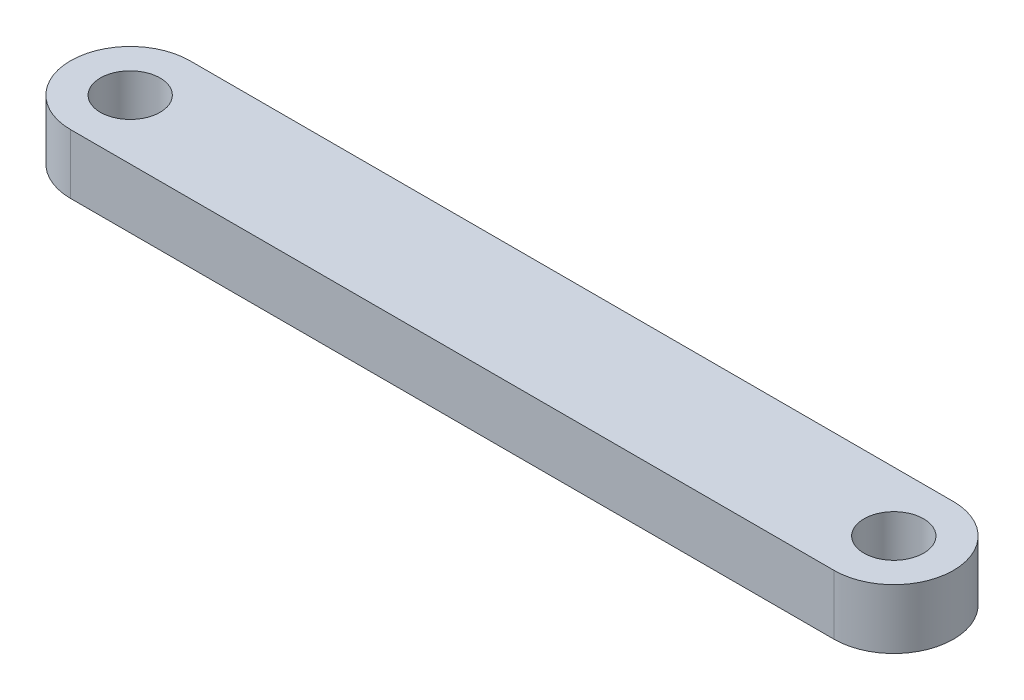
ISO-10303-21;
HEADER;
FILE_DESCRIPTION(('STEP AP214'),'2;1');
FILE_NAME('part.step','',(''),(''),'','','');
FILE_SCHEMA(('AUTOMOTIVE_DESIGN { 1 0 10303 214 1 1 1 1 }'));
ENDSEC;
DATA;
#1=APPLICATION_CONTEXT('core data for automotive mechanical design processes');
#2=APPLICATION_PROTOCOL_DEFINITION('international standard','automotive_design',2000,#1);
#3=PRODUCT_CONTEXT('',#1,'mechanical');
#4=PRODUCT('Part','Part','',(#3));
#5=PRODUCT_RELATED_PRODUCT_CATEGORY('part','',(#4));
#6=PRODUCT_DEFINITION_FORMATION('','',#4);
#7=PRODUCT_DEFINITION_CONTEXT('part definition',#1,'design');
#8=PRODUCT_DEFINITION('design','',#6,#7);
#9=PRODUCT_DEFINITION_SHAPE('','',#8);
#10=(LENGTH_UNIT() NAMED_UNIT(*) SI_UNIT(.MILLI.,.METRE.));
#11=(NAMED_UNIT(*) PLANE_ANGLE_UNIT() SI_UNIT($,.RADIAN.));
#12=(NAMED_UNIT(*) SI_UNIT($,.STERADIAN.) SOLID_ANGLE_UNIT());
#13=UNCERTAINTY_MEASURE_WITH_UNIT(LENGTH_MEASURE(1.E-05),#10,'distance_accuracy_value','');
#14=(GEOMETRIC_REPRESENTATION_CONTEXT(3) GLOBAL_UNCERTAINTY_ASSIGNED_CONTEXT((#13)) GLOBAL_UNIT_ASSIGNED_CONTEXT((#10,
#11,#12)) REPRESENTATION_CONTEXT('',''));
#15=CARTESIAN_POINT('',(0.,0.,0.));
#16=DIRECTION('',(0.,0.,1.));
#17=DIRECTION('',(1.,0.,0.));
#18=AXIS2_PLACEMENT_3D('',#15,#16,#17);
#19=CARTESIAN_POINT('',(-640.,50.,0.));
#20=DIRECTION('',(0.,1.,0.));
#21=DIRECTION('',(0.,0.,1.));
#22=AXIS2_PLACEMENT_3D('',#19,#20,#21);
#23=PLANE('',#22);
#24=CARTESIAN_POINT('',(-640.,50.,0.));
#25=DIRECTION('',(0.,1.,0.));
#26=DIRECTION('',(0.,0.,1.));
#27=AXIS2_PLACEMENT_3D('',#24,#25,#26);
#28=CIRCLE('',#27,50.);
#29=CARTESIAN_POINT('',(-640.,50.,50.));
#30=VERTEX_POINT('',#29);
#31=EDGE_CURVE('E113',#30,#30,#28,.T.);
#32=ORIENTED_EDGE('',*,*,#31,.F.);
#33=EDGE_LOOP('',(#32));
#34=FACE_BOUND('',#33,.T.);
#35=CARTESIAN_POINT('',(-640.,50.,0.));
#36=DIRECTION('',(0.,1.,0.));
#37=DIRECTION('',(0.,0.,1.));
#38=AXIS2_PLACEMENT_3D('',#35,#36,#37);
#39=CIRCLE('',#38,100.);
#40=CARTESIAN_POINT('',(-640.,50.,-100.));
#41=VERTEX_POINT('',#40);
#42=CARTESIAN_POINT('',(-640.,50.,100.));
#43=VERTEX_POINT('',#42);
#44=EDGE_CURVE('E91',#41,#43,#39,.T.);
#45=ORIENTED_EDGE('',*,*,#44,.T.);
#46=DIRECTION('',(1.,0.,0.));
#47=VECTOR('',#46,1.);
#48=CARTESIAN_POINT('',(-640.,50.,100.));
#49=LINE('',#48,#47);
#50=CARTESIAN_POINT('',(640.,50.,100.));
#51=VERTEX_POINT('',#50);
#52=EDGE_CURVE('E86',#43,#51,#49,.T.);
#53=ORIENTED_EDGE('',*,*,#52,.T.);
#54=CARTESIAN_POINT('',(640.,50.,0.));
#55=DIRECTION('',(0.,1.,0.));
#56=DIRECTION('',(0.,0.,1.));
#57=AXIS2_PLACEMENT_3D('',#54,#55,#56);
#58=CIRCLE('',#57,100.);
#59=CARTESIAN_POINT('',(640.,50.,-100.));
#60=VERTEX_POINT('',#59);
#61=EDGE_CURVE('E89',#51,#60,#58,.T.);
#62=ORIENTED_EDGE('',*,*,#61,.T.);
#63=DIRECTION('',(-1.,0.,0.));
#64=VECTOR('',#63,1.);
#65=CARTESIAN_POINT('',(-640.,50.,-100.));
#66=LINE('',#65,#64);
#67=EDGE_CURVE('E56',#60,#41,#66,.T.);
#68=ORIENTED_EDGE('',*,*,#67,.T.);
#69=EDGE_LOOP('',(#45,#53,#62,#68));
#70=FACE_BOUND('',#69,.T.);
#71=CARTESIAN_POINT('',(640.,50.,0.));
#72=DIRECTION('',(0.,1.,0.));
#73=DIRECTION('',(0.,0.,1.));
#74=AXIS2_PLACEMENT_3D('',#71,#72,#73);
#75=CIRCLE('',#74,50.);
#76=CARTESIAN_POINT('',(640.,50.,50.));
#77=VERTEX_POINT('',#76);
#78=EDGE_CURVE('E134',#77,#77,#75,.T.);
#79=ORIENTED_EDGE('',*,*,#78,.F.);
#80=EDGE_LOOP('',(#79));
#81=FACE_BOUND('',#80,.T.);
#82=ADVANCED_FACE('F38',(#34,#70,#81),#23,.T.);
#83=CARTESIAN_POINT('',(-640.,-50.,0.));
#84=DIRECTION('',(0.,1.,0.));
#85=DIRECTION('',(0.,0.,1.));
#86=AXIS2_PLACEMENT_3D('',#83,#84,#85);
#87=PLANE('',#86);
#88=CARTESIAN_POINT('',(-640.,-50.,0.));
#89=DIRECTION('',(0.,1.,0.));
#90=DIRECTION('',(0.,0.,1.));
#91=AXIS2_PLACEMENT_3D('',#88,#89,#90);
#92=CIRCLE('',#91,100.);
#93=CARTESIAN_POINT('',(-640.,-50.,-100.));
#94=VERTEX_POINT('',#93);
#95=CARTESIAN_POINT('',(-640.,-50.,100.));
#96=VERTEX_POINT('',#95);
#97=EDGE_CURVE('E109',#94,#96,#92,.T.);
#98=ORIENTED_EDGE('',*,*,#97,.F.);
#99=DIRECTION('',(-1.,0.,0.));
#100=VECTOR('',#99,1.);
#101=CARTESIAN_POINT('',(-640.,-50.,-100.));
#102=LINE('',#101,#100);
#103=CARTESIAN_POINT('',(640.,-50.,-100.));
#104=VERTEX_POINT('',#103);
#105=EDGE_CURVE('E79',#104,#94,#102,.T.);
#106=ORIENTED_EDGE('',*,*,#105,.F.);
#107=CARTESIAN_POINT('',(640.,-50.,0.));
#108=DIRECTION('',(0.,1.,0.));
#109=DIRECTION('',(0.,0.,1.));
#110=AXIS2_PLACEMENT_3D('',#107,#108,#109);
#111=CIRCLE('',#110,100.);
#112=CARTESIAN_POINT('',(640.,-50.,100.));
#113=VERTEX_POINT('',#112);
#114=EDGE_CURVE('E73',#113,#104,#111,.T.);
#115=ORIENTED_EDGE('',*,*,#114,.F.);
#116=DIRECTION('',(1.,0.,0.));
#117=VECTOR('',#116,1.);
#118=CARTESIAN_POINT('',(-640.,-50.,100.));
#119=LINE('',#118,#117);
#120=EDGE_CURVE('E96',#96,#113,#119,.T.);
#121=ORIENTED_EDGE('',*,*,#120,.F.);
#122=EDGE_LOOP('',(#98,#106,#115,#121));
#123=FACE_BOUND('',#122,.T.);
#124=CARTESIAN_POINT('',(-640.,-50.,0.));
#125=DIRECTION('',(0.,1.,0.));
#126=DIRECTION('',(0.,0.,1.));
#127=AXIS2_PLACEMENT_3D('',#124,#125,#126);
#128=CIRCLE('',#127,50.);
#129=CARTESIAN_POINT('',(-640.,-50.,50.));
#130=VERTEX_POINT('',#129);
#131=EDGE_CURVE('E130',#130,#130,#128,.T.);
#132=ORIENTED_EDGE('',*,*,#131,.T.);
#133=EDGE_LOOP('',(#132));
#134=FACE_BOUND('',#133,.T.);
#135=CARTESIAN_POINT('',(640.,-50.,0.));
#136=DIRECTION('',(0.,1.,0.));
#137=DIRECTION('',(0.,0.,1.));
#138=AXIS2_PLACEMENT_3D('',#135,#136,#137);
#139=CIRCLE('',#138,50.);
#140=CARTESIAN_POINT('',(640.,-50.,50.));
#141=VERTEX_POINT('',#140);
#142=EDGE_CURVE('E138',#141,#141,#139,.T.);
#143=ORIENTED_EDGE('',*,*,#142,.T.);
#144=EDGE_LOOP('',(#143));
#145=FACE_BOUND('',#144,.T.);
#146=ADVANCED_FACE('F124',(#123,#134,#145),#87,.F.);
#147=CARTESIAN_POINT('',(-640.,50.,0.));
#148=DIRECTION('',(0.,-1.,0.));
#149=DIRECTION('',(0.,0.,-1.));
#150=AXIS2_PLACEMENT_3D('',#147,#148,#149);
#151=CYLINDRICAL_SURFACE('',#150,100.);
#152=ORIENTED_EDGE('',*,*,#97,.T.);
#153=DIRECTION('',(0.,-1.,0.));
#154=VECTOR('',#153,1.);
#155=CARTESIAN_POINT('',(-640.,50.,100.));
#156=LINE('',#155,#154);
#157=EDGE_CURVE('E11',#43,#96,#156,.T.);
#158=ORIENTED_EDGE('',*,*,#157,.F.);
#159=ORIENTED_EDGE('',*,*,#44,.F.);
#160=DIRECTION('',(0.,-1.,0.));
#161=VECTOR('',#160,1.);
#162=CARTESIAN_POINT('',(-640.,50.,-100.));
#163=LINE('',#162,#161);
#164=EDGE_CURVE('E105',#41,#94,#163,.T.);
#165=ORIENTED_EDGE('',*,*,#164,.T.);
#166=EDGE_LOOP('',(#152,#158,#159,#165));
#167=FACE_BOUND('',#166,.T.);
#168=ADVANCED_FACE('F40',(#167),#151,.T.);
#169=CARTESIAN_POINT('',(-640.,50.,100.));
#170=DIRECTION('',(0.,0.,-1.));
#171=DIRECTION('',(-1.,0.,0.));
#172=AXIS2_PLACEMENT_3D('',#169,#170,#171);
#173=PLANE('',#172);
#174=ORIENTED_EDGE('',*,*,#120,.T.);
#175=DIRECTION('',(0.,-1.,0.));
#176=VECTOR('',#175,1.);
#177=CARTESIAN_POINT('',(640.,50.,100.));
#178=LINE('',#177,#176);
#179=EDGE_CURVE('E48',#51,#113,#178,.T.);
#180=ORIENTED_EDGE('',*,*,#179,.F.);
#181=ORIENTED_EDGE('',*,*,#52,.F.);
#182=ORIENTED_EDGE('',*,*,#157,.T.);
#183=EDGE_LOOP('',(#174,#180,#181,#182));
#184=FACE_BOUND('',#183,.T.);
#185=ADVANCED_FACE('F95',(#184),#173,.F.);
#186=CARTESIAN_POINT('',(640.,50.,0.));
#187=DIRECTION('',(0.,-1.,0.));
#188=DIRECTION('',(0.,0.,-1.));
#189=AXIS2_PLACEMENT_3D('',#186,#187,#188);
#190=CYLINDRICAL_SURFACE('',#189,100.);
#191=ORIENTED_EDGE('',*,*,#114,.T.);
#192=DIRECTION('',(0.,-1.,0.));
#193=VECTOR('',#192,1.);
#194=CARTESIAN_POINT('',(640.,50.,-100.));
#195=LINE('',#194,#193);
#196=EDGE_CURVE('E98',#60,#104,#195,.T.);
#197=ORIENTED_EDGE('',*,*,#196,.F.);
#198=ORIENTED_EDGE('',*,*,#61,.F.);
#199=ORIENTED_EDGE('',*,*,#179,.T.);
#200=EDGE_LOOP('',(#191,#197,#198,#199));
#201=FACE_BOUND('',#200,.T.);
#202=ADVANCED_FACE('F99',(#201),#190,.T.);
#203=CARTESIAN_POINT('',(-640.,50.,-100.));
#204=DIRECTION('',(0.,0.,1.));
#205=DIRECTION('',(1.,0.,0.));
#206=AXIS2_PLACEMENT_3D('',#203,#204,#205);
#207=PLANE('',#206);
#208=ORIENTED_EDGE('',*,*,#105,.T.);
#209=ORIENTED_EDGE('',*,*,#164,.F.);
#210=ORIENTED_EDGE('',*,*,#67,.F.);
#211=ORIENTED_EDGE('',*,*,#196,.T.);
#212=EDGE_LOOP('',(#208,#209,#210,#211));
#213=FACE_BOUND('',#212,.T.);
#214=ADVANCED_FACE('F121',(#213),#207,.F.);
#215=CARTESIAN_POINT('',(-640.,50.,0.));
#216=DIRECTION('',(0.,-1.,0.));
#217=DIRECTION('',(0.,0.,-1.));
#218=AXIS2_PLACEMENT_3D('',#215,#216,#217);
#219=CYLINDRICAL_SURFACE('',#218,50.);
#220=ORIENTED_EDGE('',*,*,#31,.T.);
#221=EDGE_LOOP('',(#220));
#222=FACE_BOUND('',#221,.T.);
#223=ORIENTED_EDGE('',*,*,#131,.F.);
#224=EDGE_LOOP('',(#223));
#225=FACE_BOUND('',#224,.T.);
#226=ADVANCED_FACE('F156',(#222,#225),#219,.F.);
#227=CARTESIAN_POINT('',(640.,50.,0.));
#228=DIRECTION('',(0.,-1.,0.));
#229=DIRECTION('',(0.,0.,-1.));
#230=AXIS2_PLACEMENT_3D('',#227,#228,#229);
#231=CYLINDRICAL_SURFACE('',#230,50.);
#232=ORIENTED_EDGE('',*,*,#78,.T.);
#233=EDGE_LOOP('',(#232));
#234=FACE_BOUND('',#233,.T.);
#235=ORIENTED_EDGE('',*,*,#142,.F.);
#236=EDGE_LOOP('',(#235));
#237=FACE_BOUND('',#236,.T.);
#238=ADVANCED_FACE('F145',(#234,#237),#231,.F.);
#239=CLOSED_SHELL('',(#82,#146,#168,#185,#202,#214,#226,#238));
#240=MANIFOLD_SOLID_BREP('B2',#239);
#241=ADVANCED_BREP_SHAPE_REPRESENTATION('',(#18,#240),#14);
#242=SHAPE_DEFINITION_REPRESENTATION(#9,#241);
ENDSEC;
END-ISO-10303-21;
